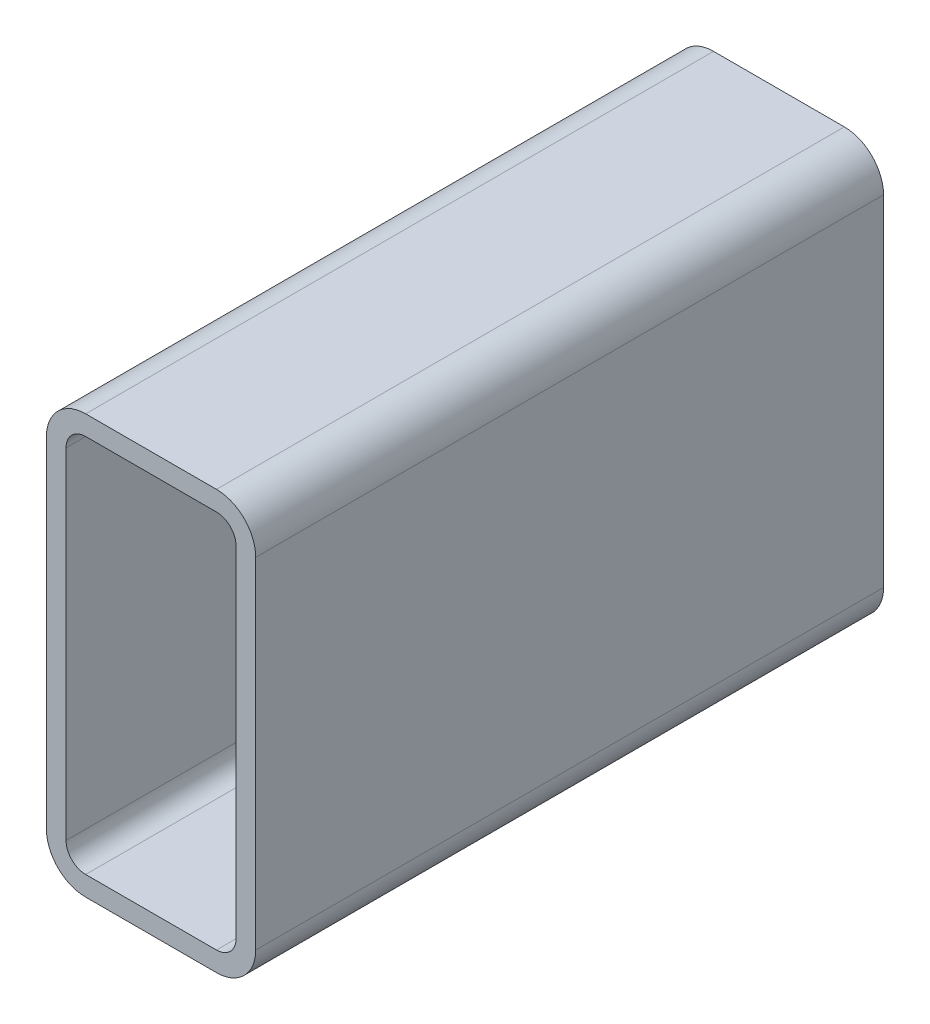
ISO-10303-21;
HEADER;
FILE_DESCRIPTION(('STEP AP214'),'2;1');
FILE_NAME('part.step','',(''),(''),'','','');
FILE_SCHEMA(('AUTOMOTIVE_DESIGN { 1 0 10303 214 1 1 1 1 }'));
ENDSEC;
DATA;
#1=APPLICATION_CONTEXT('core data for automotive mechanical design processes');
#2=APPLICATION_PROTOCOL_DEFINITION('international standard','automotive_design',2000,#1);
#3=PRODUCT_CONTEXT('',#1,'mechanical');
#4=PRODUCT('Part','Part','',(#3));
#5=PRODUCT_RELATED_PRODUCT_CATEGORY('part','',(#4));
#6=PRODUCT_DEFINITION_FORMATION('','',#4);
#7=PRODUCT_DEFINITION_CONTEXT('part definition',#1,'design');
#8=PRODUCT_DEFINITION('design','',#6,#7);
#9=PRODUCT_DEFINITION_SHAPE('','',#8);
#10=(LENGTH_UNIT() NAMED_UNIT(*) SI_UNIT(.MILLI.,.METRE.));
#11=(NAMED_UNIT(*) PLANE_ANGLE_UNIT() SI_UNIT($,.RADIAN.));
#12=(NAMED_UNIT(*) SI_UNIT($,.STERADIAN.) SOLID_ANGLE_UNIT());
#13=UNCERTAINTY_MEASURE_WITH_UNIT(LENGTH_MEASURE(1.E-05),#10,'distance_accuracy_value','');
#14=(GEOMETRIC_REPRESENTATION_CONTEXT(3) GLOBAL_UNCERTAINTY_ASSIGNED_CONTEXT((#13)) GLOBAL_UNIT_ASSIGNED_CONTEXT((#10,
#11,#12)) REPRESENTATION_CONTEXT('',''));
#15=CARTESIAN_POINT('',(0.,0.,0.));
#16=DIRECTION('',(0.,0.,1.));
#17=DIRECTION('',(1.,0.,0.));
#18=AXIS2_PLACEMENT_3D('',#15,#16,#17);
#19=CARTESIAN_POINT('',(20.7251778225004,186.116130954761,304.8));
#20=DIRECTION('',(0.,0.,1.));
#21=DIRECTION('',(1.,0.,0.));
#22=AXIS2_PLACEMENT_3D('',#19,#20,#21);
#23=PLANE('',#22);
#24=CARTESIAN_POINT('',(20.7251778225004,186.116130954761,304.8));
#25=DIRECTION('',(0.,0.,1.));
#26=DIRECTION('',(1.,0.,0.));
#27=AXIS2_PLACEMENT_3D('',#24,#25,#26);
#28=CIRCLE('',#27,19.05);
#29=CARTESIAN_POINT('',(20.7251778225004,205.166130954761,304.8));
#30=VERTEX_POINT('',#29);
#31=CARTESIAN_POINT('',(1.67517782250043,186.116130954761,304.8));
#32=VERTEX_POINT('',#31);
#33=EDGE_CURVE('E211',#30,#32,#28,.T.);
#34=ORIENTED_EDGE('',*,*,#33,.T.);
#35=DIRECTION('',(0.,-1.,0.));
#36=VECTOR('',#35,1.);
#37=CARTESIAN_POINT('',(1.67517782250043,21.0161309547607,304.8));
#38=LINE('',#37,#36);
#39=CARTESIAN_POINT('',(1.67517782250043,21.0161309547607,304.8));
#40=VERTEX_POINT('',#39);
#41=EDGE_CURVE('E214',#32,#40,#38,.T.);
#42=ORIENTED_EDGE('',*,*,#41,.T.);
#43=CARTESIAN_POINT('',(20.7251778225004,21.0161309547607,304.8));
#44=DIRECTION('',(0.,0.,1.));
#45=DIRECTION('',(1.,0.,0.));
#46=AXIS2_PLACEMENT_3D('',#43,#44,#45);
#47=CIRCLE('',#46,19.05);
#48=CARTESIAN_POINT('',(20.7251778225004,1.96613095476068,304.8));
#49=VERTEX_POINT('',#48);
#50=EDGE_CURVE('E217',#40,#49,#47,.T.);
#51=ORIENTED_EDGE('',*,*,#50,.T.);
#52=DIRECTION('',(1.,0.,0.));
#53=VECTOR('',#52,1.);
#54=CARTESIAN_POINT('',(84.2251778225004,1.96613095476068,304.8));
#55=LINE('',#54,#53);
#56=CARTESIAN_POINT('',(84.2251778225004,1.96613095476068,304.8));
#57=VERTEX_POINT('',#56);
#58=EDGE_CURVE('E219',#49,#57,#55,.T.);
#59=ORIENTED_EDGE('',*,*,#58,.T.);
#60=CARTESIAN_POINT('',(84.2251778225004,21.0161309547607,304.8));
#61=DIRECTION('',(0.,0.,1.));
#62=DIRECTION('',(1.,0.,0.));
#63=AXIS2_PLACEMENT_3D('',#60,#61,#62);
#64=CIRCLE('',#63,19.05);
#65=CARTESIAN_POINT('',(103.2751778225,21.0161309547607,304.8));
#66=VERTEX_POINT('',#65);
#67=EDGE_CURVE('E221',#57,#66,#64,.T.);
#68=ORIENTED_EDGE('',*,*,#67,.T.);
#69=DIRECTION('',(0.,1.,0.));
#70=VECTOR('',#69,1.);
#71=CARTESIAN_POINT('',(103.2751778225,186.116130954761,304.8));
#72=LINE('',#71,#70);
#73=CARTESIAN_POINT('',(103.2751778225,186.116130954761,304.8));
#74=VERTEX_POINT('',#73);
#75=EDGE_CURVE('E223',#66,#74,#72,.T.);
#76=ORIENTED_EDGE('',*,*,#75,.T.);
#77=CARTESIAN_POINT('',(84.2251778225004,186.116130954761,304.8));
#78=DIRECTION('',(0.,0.,1.));
#79=DIRECTION('',(1.,0.,0.));
#80=AXIS2_PLACEMENT_3D('',#77,#78,#79);
#81=CIRCLE('',#80,19.05);
#82=CARTESIAN_POINT('',(84.2251778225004,205.166130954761,304.8));
#83=VERTEX_POINT('',#82);
#84=EDGE_CURVE('E225',#74,#83,#81,.T.);
#85=ORIENTED_EDGE('',*,*,#84,.T.);
#86=DIRECTION('',(-1.,0.,0.));
#87=VECTOR('',#86,1.);
#88=CARTESIAN_POINT('',(20.7251778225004,205.166130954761,304.8));
#89=LINE('',#88,#87);
#90=EDGE_CURVE('E227',#83,#30,#89,.T.);
#91=ORIENTED_EDGE('',*,*,#90,.T.);
#92=EDGE_LOOP('',(#34,#42,#51,#59,#68,#76,#85,#91));
#93=FACE_BOUND('',#92,.T.);
#94=DIRECTION('',(0.,-1.,0.));
#95=VECTOR('',#94,1.);
#96=CARTESIAN_POINT('',(11.2001778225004,21.0161309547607,304.8));
#97=LINE('',#96,#95);
#98=CARTESIAN_POINT('',(11.2001778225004,186.116130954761,304.8));
#99=VERTEX_POINT('',#98);
#100=CARTESIAN_POINT('',(11.2001778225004,21.0161309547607,304.8));
#101=VERTEX_POINT('',#100);
#102=EDGE_CURVE('E154',#99,#101,#97,.T.);
#103=ORIENTED_EDGE('',*,*,#102,.F.);
#104=CARTESIAN_POINT('',(20.7251778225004,186.116130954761,304.8));
#105=DIRECTION('',(0.,0.,1.));
#106=DIRECTION('',(1.,0.,0.));
#107=AXIS2_PLACEMENT_3D('',#104,#105,#106);
#108=CIRCLE('',#107,9.52500000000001);
#109=CARTESIAN_POINT('',(20.7251778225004,195.641130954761,304.8));
#110=VERTEX_POINT('',#109);
#111=EDGE_CURVE('E146',#110,#99,#108,.T.);
#112=ORIENTED_EDGE('',*,*,#111,.F.);
#113=DIRECTION('',(-1.,0.,0.));
#114=VECTOR('',#113,1.);
#115=CARTESIAN_POINT('',(20.7251778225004,195.641130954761,304.8));
#116=LINE('',#115,#114);
#117=CARTESIAN_POINT('',(84.2251778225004,195.641130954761,304.8));
#118=VERTEX_POINT('',#117);
#119=EDGE_CURVE('E179',#118,#110,#116,.T.);
#120=ORIENTED_EDGE('',*,*,#119,.F.);
#121=CARTESIAN_POINT('',(84.2251778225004,186.116130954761,304.8));
#122=DIRECTION('',(0.,0.,1.));
#123=DIRECTION('',(1.,0.,0.));
#124=AXIS2_PLACEMENT_3D('',#121,#122,#123);
#125=CIRCLE('',#124,9.52500000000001);
#126=CARTESIAN_POINT('',(93.7501778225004,186.116130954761,304.8));
#127=VERTEX_POINT('',#126);
#128=EDGE_CURVE('E177',#127,#118,#125,.T.);
#129=ORIENTED_EDGE('',*,*,#128,.F.);
#130=DIRECTION('',(0.,1.,0.));
#131=VECTOR('',#130,1.);
#132=CARTESIAN_POINT('',(93.7501778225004,186.116130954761,304.8));
#133=LINE('',#132,#131);
#134=CARTESIAN_POINT('',(93.7501778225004,21.0161309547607,304.8));
#135=VERTEX_POINT('',#134);
#136=EDGE_CURVE('E175',#135,#127,#133,.T.);
#137=ORIENTED_EDGE('',*,*,#136,.F.);
#138=CARTESIAN_POINT('',(84.2251778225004,21.0161309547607,304.8));
#139=DIRECTION('',(0.,0.,1.));
#140=DIRECTION('',(1.,0.,0.));
#141=AXIS2_PLACEMENT_3D('',#138,#139,#140);
#142=CIRCLE('',#141,9.52500000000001);
#143=CARTESIAN_POINT('',(84.2251778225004,11.4911309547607,304.8));
#144=VERTEX_POINT('',#143);
#145=EDGE_CURVE('E173',#144,#135,#142,.T.);
#146=ORIENTED_EDGE('',*,*,#145,.F.);
#147=DIRECTION('',(1.,0.,0.));
#148=VECTOR('',#147,1.);
#149=CARTESIAN_POINT('',(84.2251778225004,11.4911309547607,304.8));
#150=LINE('',#149,#148);
#151=CARTESIAN_POINT('',(20.7251778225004,11.4911309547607,304.8));
#152=VERTEX_POINT('',#151);
#153=EDGE_CURVE('E169',#152,#144,#150,.T.);
#154=ORIENTED_EDGE('',*,*,#153,.F.);
#155=CARTESIAN_POINT('',(20.7251778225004,21.0161309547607,304.8));
#156=DIRECTION('',(0.,0.,1.));
#157=DIRECTION('',(1.,0.,0.));
#158=AXIS2_PLACEMENT_3D('',#155,#156,#157);
#159=CIRCLE('',#158,9.525);
#160=EDGE_CURVE('E167',#101,#152,#159,.T.);
#161=ORIENTED_EDGE('',*,*,#160,.F.);
#162=EDGE_LOOP('',(#103,#112,#120,#129,#137,#146,#154,#161));
#163=FACE_BOUND('',#162,.T.);
#164=ADVANCED_FACE('F33',(#93,#163),#23,.T.);
#165=CARTESIAN_POINT('',(20.7251778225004,186.116130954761,0.));
#166=DIRECTION('',(0.,0.,1.));
#167=DIRECTION('',(1.,0.,0.));
#168=AXIS2_PLACEMENT_3D('',#165,#166,#167);
#169=PLANE('',#168);
#170=CARTESIAN_POINT('',(20.7251778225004,186.116130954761,0.));
#171=DIRECTION('',(0.,0.,1.));
#172=DIRECTION('',(1.,0.,0.));
#173=AXIS2_PLACEMENT_3D('',#170,#171,#172);
#174=CIRCLE('',#173,19.05);
#175=CARTESIAN_POINT('',(20.7251778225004,205.166130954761,0.));
#176=VERTEX_POINT('',#175);
#177=CARTESIAN_POINT('',(1.67517782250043,186.116130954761,0.));
#178=VERTEX_POINT('',#177);
#179=EDGE_CURVE('E162',#176,#178,#174,.T.);
#180=ORIENTED_EDGE('',*,*,#179,.F.);
#181=DIRECTION('',(-1.,0.,0.));
#182=VECTOR('',#181,1.);
#183=CARTESIAN_POINT('',(20.7251778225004,205.166130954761,0.));
#184=LINE('',#183,#182);
#185=CARTESIAN_POINT('',(84.2251778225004,205.166130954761,0.));
#186=VERTEX_POINT('',#185);
#187=EDGE_CURVE('E215',#186,#176,#184,.T.);
#188=ORIENTED_EDGE('',*,*,#187,.F.);
#189=CARTESIAN_POINT('',(84.2251778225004,186.116130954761,0.));
#190=DIRECTION('',(0.,0.,1.));
#191=DIRECTION('',(1.,0.,0.));
#192=AXIS2_PLACEMENT_3D('',#189,#190,#191);
#193=CIRCLE('',#192,19.05);
#194=CARTESIAN_POINT('',(103.2751778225,186.116130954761,0.));
#195=VERTEX_POINT('',#194);
#196=EDGE_CURVE('E242',#195,#186,#193,.T.);
#197=ORIENTED_EDGE('',*,*,#196,.F.);
#198=DIRECTION('',(0.,1.,0.));
#199=VECTOR('',#198,1.);
#200=CARTESIAN_POINT('',(103.2751778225,186.116130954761,0.));
#201=LINE('',#200,#199);
#202=CARTESIAN_POINT('',(103.2751778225,21.0161309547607,0.));
#203=VERTEX_POINT('',#202);
#204=EDGE_CURVE('E240',#203,#195,#201,.T.);
#205=ORIENTED_EDGE('',*,*,#204,.F.);
#206=CARTESIAN_POINT('',(84.2251778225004,21.0161309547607,0.));
#207=DIRECTION('',(0.,0.,1.));
#208=DIRECTION('',(1.,0.,0.));
#209=AXIS2_PLACEMENT_3D('',#206,#207,#208);
#210=CIRCLE('',#209,19.05);
#211=CARTESIAN_POINT('',(84.2251778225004,1.96613095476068,0.));
#212=VERTEX_POINT('',#211);
#213=EDGE_CURVE('E238',#212,#203,#210,.T.);
#214=ORIENTED_EDGE('',*,*,#213,.F.);
#215=DIRECTION('',(1.,0.,0.));
#216=VECTOR('',#215,1.);
#217=CARTESIAN_POINT('',(84.2251778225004,1.96613095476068,0.));
#218=LINE('',#217,#216);
#219=CARTESIAN_POINT('',(20.7251778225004,1.96613095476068,0.));
#220=VERTEX_POINT('',#219);
#221=EDGE_CURVE('E236',#220,#212,#218,.T.);
#222=ORIENTED_EDGE('',*,*,#221,.F.);
#223=CARTESIAN_POINT('',(20.7251778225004,21.0161309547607,0.));
#224=DIRECTION('',(0.,0.,1.));
#225=DIRECTION('',(1.,0.,0.));
#226=AXIS2_PLACEMENT_3D('',#223,#224,#225);
#227=CIRCLE('',#226,19.05);
#228=CARTESIAN_POINT('',(1.67517782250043,21.0161309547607,0.));
#229=VERTEX_POINT('',#228);
#230=EDGE_CURVE('E234',#229,#220,#227,.T.);
#231=ORIENTED_EDGE('',*,*,#230,.F.);
#232=DIRECTION('',(0.,-1.,0.));
#233=VECTOR('',#232,1.);
#234=CARTESIAN_POINT('',(1.67517782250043,21.0161309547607,0.));
#235=LINE('',#234,#233);
#236=EDGE_CURVE('E232',#178,#229,#235,.T.);
#237=ORIENTED_EDGE('',*,*,#236,.F.);
#238=EDGE_LOOP('',(#180,#188,#197,#205,#214,#222,#231,#237));
#239=FACE_BOUND('',#238,.T.);
#240=CARTESIAN_POINT('',(20.7251778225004,186.116130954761,0.));
#241=DIRECTION('',(0.,0.,1.));
#242=DIRECTION('',(1.,0.,0.));
#243=AXIS2_PLACEMENT_3D('',#240,#241,#242);
#244=CIRCLE('',#243,9.52500000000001);
#245=CARTESIAN_POINT('',(20.7251778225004,195.641130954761,0.));
#246=VERTEX_POINT('',#245);
#247=CARTESIAN_POINT('',(11.2001778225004,186.116130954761,0.));
#248=VERTEX_POINT('',#247);
#249=EDGE_CURVE('E56',#246,#248,#244,.T.);
#250=ORIENTED_EDGE('',*,*,#249,.T.);
#251=DIRECTION('',(0.,-1.,0.));
#252=VECTOR('',#251,1.);
#253=CARTESIAN_POINT('',(11.2001778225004,21.0161309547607,0.));
#254=LINE('',#253,#252);
#255=CARTESIAN_POINT('',(11.2001778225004,21.0161309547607,0.));
#256=VERTEX_POINT('',#255);
#257=EDGE_CURVE('E161',#248,#256,#254,.T.);
#258=ORIENTED_EDGE('',*,*,#257,.T.);
#259=CARTESIAN_POINT('',(20.7251778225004,21.0161309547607,0.));
#260=DIRECTION('',(0.,0.,1.));
#261=DIRECTION('',(1.,0.,0.));
#262=AXIS2_PLACEMENT_3D('',#259,#260,#261);
#263=CIRCLE('',#262,9.525);
#264=CARTESIAN_POINT('',(20.7251778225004,11.4911309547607,0.));
#265=VERTEX_POINT('',#264);
#266=EDGE_CURVE('E183',#256,#265,#263,.T.);
#267=ORIENTED_EDGE('',*,*,#266,.T.);
#268=DIRECTION('',(1.,0.,0.));
#269=VECTOR('',#268,1.);
#270=CARTESIAN_POINT('',(84.2251778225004,11.4911309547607,0.));
#271=LINE('',#270,#269);
#272=CARTESIAN_POINT('',(84.2251778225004,11.4911309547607,0.));
#273=VERTEX_POINT('',#272);
#274=EDGE_CURVE('E186',#265,#273,#271,.T.);
#275=ORIENTED_EDGE('',*,*,#274,.T.);
#276=CARTESIAN_POINT('',(84.2251778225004,21.0161309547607,0.));
#277=DIRECTION('',(0.,0.,1.));
#278=DIRECTION('',(1.,0.,0.));
#279=AXIS2_PLACEMENT_3D('',#276,#277,#278);
#280=CIRCLE('',#279,9.52500000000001);
#281=CARTESIAN_POINT('',(93.7501778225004,21.0161309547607,0.));
#282=VERTEX_POINT('',#281);
#283=EDGE_CURVE('E189',#273,#282,#280,.T.);
#284=ORIENTED_EDGE('',*,*,#283,.T.);
#285=DIRECTION('',(0.,1.,0.));
#286=VECTOR('',#285,1.);
#287=CARTESIAN_POINT('',(93.7501778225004,186.116130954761,0.));
#288=LINE('',#287,#286);
#289=CARTESIAN_POINT('',(93.7501778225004,186.116130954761,0.));
#290=VERTEX_POINT('',#289);
#291=EDGE_CURVE('E192',#282,#290,#288,.T.);
#292=ORIENTED_EDGE('',*,*,#291,.T.);
#293=CARTESIAN_POINT('',(84.2251778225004,186.116130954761,0.));
#294=DIRECTION('',(0.,0.,1.));
#295=DIRECTION('',(1.,0.,0.));
#296=AXIS2_PLACEMENT_3D('',#293,#294,#295);
#297=CIRCLE('',#296,9.52500000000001);
#298=CARTESIAN_POINT('',(84.2251778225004,195.641130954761,0.));
#299=VERTEX_POINT('',#298);
#300=EDGE_CURVE('E195',#290,#299,#297,.T.);
#301=ORIENTED_EDGE('',*,*,#300,.T.);
#302=DIRECTION('',(-1.,0.,0.));
#303=VECTOR('',#302,1.);
#304=CARTESIAN_POINT('',(20.7251778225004,195.641130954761,0.));
#305=LINE('',#304,#303);
#306=EDGE_CURVE('E155',#299,#246,#305,.T.);
#307=ORIENTED_EDGE('',*,*,#306,.T.);
#308=EDGE_LOOP('',(#250,#258,#267,#275,#284,#292,#301,#307));
#309=FACE_BOUND('',#308,.T.);
#310=ADVANCED_FACE('F272',(#239,#309),#169,.F.);
#311=CARTESIAN_POINT('',(20.7251778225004,186.116130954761,304.8));
#312=DIRECTION('',(0.,0.,-1.));
#313=DIRECTION('',(-1.,0.,0.));
#314=AXIS2_PLACEMENT_3D('',#311,#312,#313);
#315=CYLINDRICAL_SURFACE('',#314,19.05);
#316=ORIENTED_EDGE('',*,*,#179,.T.);
#317=DIRECTION('',(0.,0.,-1.));
#318=VECTOR('',#317,1.);
#319=CARTESIAN_POINT('',(1.67517782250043,186.116130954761,304.8));
#320=LINE('',#319,#318);
#321=EDGE_CURVE('E11',#32,#178,#320,.T.);
#322=ORIENTED_EDGE('',*,*,#321,.F.);
#323=ORIENTED_EDGE('',*,*,#33,.F.);
#324=DIRECTION('',(0.,0.,-1.));
#325=VECTOR('',#324,1.);
#326=CARTESIAN_POINT('',(20.7251778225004,205.166130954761,304.8));
#327=LINE('',#326,#325);
#328=EDGE_CURVE('E229',#30,#176,#327,.T.);
#329=ORIENTED_EDGE('',*,*,#328,.T.);
#330=EDGE_LOOP('',(#316,#322,#323,#329));
#331=FACE_BOUND('',#330,.T.);
#332=ADVANCED_FACE('F35',(#331),#315,.T.);
#333=CARTESIAN_POINT('',(1.67517782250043,21.0161309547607,304.8));
#334=DIRECTION('',(1.,0.,0.));
#335=DIRECTION('',(0.,0.,-1.));
#336=AXIS2_PLACEMENT_3D('',#333,#334,#335);
#337=PLANE('',#336);
#338=ORIENTED_EDGE('',*,*,#236,.T.);
#339=DIRECTION('',(0.,0.,-1.));
#340=VECTOR('',#339,1.);
#341=CARTESIAN_POINT('',(1.67517782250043,21.0161309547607,304.8));
#342=LINE('',#341,#340);
#343=EDGE_CURVE('E41',#40,#229,#342,.T.);
#344=ORIENTED_EDGE('',*,*,#343,.F.);
#345=ORIENTED_EDGE('',*,*,#41,.F.);
#346=ORIENTED_EDGE('',*,*,#321,.T.);
#347=EDGE_LOOP('',(#338,#344,#345,#346));
#348=FACE_BOUND('',#347,.T.);
#349=ADVANCED_FACE('F289',(#348),#337,.F.);
#350=CARTESIAN_POINT('',(20.7251778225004,21.0161309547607,304.8));
#351=DIRECTION('',(0.,0.,-1.));
#352=DIRECTION('',(-1.,0.,0.));
#353=AXIS2_PLACEMENT_3D('',#350,#351,#352);
#354=CYLINDRICAL_SURFACE('',#353,19.05);
#355=ORIENTED_EDGE('',*,*,#230,.T.);
#356=DIRECTION('',(0.,0.,-1.));
#357=VECTOR('',#356,1.);
#358=CARTESIAN_POINT('',(20.7251778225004,1.96613095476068,304.8));
#359=LINE('',#358,#357);
#360=EDGE_CURVE('E259',#49,#220,#359,.T.);
#361=ORIENTED_EDGE('',*,*,#360,.F.);
#362=ORIENTED_EDGE('',*,*,#50,.F.);
#363=ORIENTED_EDGE('',*,*,#343,.T.);
#364=EDGE_LOOP('',(#355,#361,#362,#363));
#365=FACE_BOUND('',#364,.T.);
#366=ADVANCED_FACE('F266',(#365),#354,.T.);
#367=CARTESIAN_POINT('',(84.2251778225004,1.96613095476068,304.8));
#368=DIRECTION('',(0.,1.,0.));
#369=DIRECTION('',(0.,0.,1.));
#370=AXIS2_PLACEMENT_3D('',#367,#368,#369);
#371=PLANE('',#370);
#372=ORIENTED_EDGE('',*,*,#221,.T.);
#373=DIRECTION('',(0.,0.,-1.));
#374=VECTOR('',#373,1.);
#375=CARTESIAN_POINT('',(84.2251778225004,1.96613095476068,304.8));
#376=LINE('',#375,#374);
#377=EDGE_CURVE('E256',#57,#212,#376,.T.);
#378=ORIENTED_EDGE('',*,*,#377,.F.);
#379=ORIENTED_EDGE('',*,*,#58,.F.);
#380=ORIENTED_EDGE('',*,*,#360,.T.);
#381=EDGE_LOOP('',(#372,#378,#379,#380));
#382=FACE_BOUND('',#381,.T.);
#383=ADVANCED_FACE('F278',(#382),#371,.F.);
#384=CARTESIAN_POINT('',(84.2251778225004,21.0161309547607,304.8));
#385=DIRECTION('',(0.,0.,-1.));
#386=DIRECTION('',(-1.,0.,0.));
#387=AXIS2_PLACEMENT_3D('',#384,#385,#386);
#388=CYLINDRICAL_SURFACE('',#387,19.05);
#389=ORIENTED_EDGE('',*,*,#213,.T.);
#390=DIRECTION('',(0.,0.,-1.));
#391=VECTOR('',#390,1.);
#392=CARTESIAN_POINT('',(103.2751778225,21.0161309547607,304.8));
#393=LINE('',#392,#391);
#394=EDGE_CURVE('E253',#66,#203,#393,.T.);
#395=ORIENTED_EDGE('',*,*,#394,.F.);
#396=ORIENTED_EDGE('',*,*,#67,.F.);
#397=ORIENTED_EDGE('',*,*,#377,.T.);
#398=EDGE_LOOP('',(#389,#395,#396,#397));
#399=FACE_BOUND('',#398,.T.);
#400=ADVANCED_FACE('F282',(#399),#388,.T.);
#401=CARTESIAN_POINT('',(103.2751778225,186.116130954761,304.8));
#402=DIRECTION('',(-1.,0.,0.));
#403=DIRECTION('',(0.,0.,1.));
#404=AXIS2_PLACEMENT_3D('',#401,#402,#403);
#405=PLANE('',#404);
#406=ORIENTED_EDGE('',*,*,#204,.T.);
#407=DIRECTION('',(0.,0.,-1.));
#408=VECTOR('',#407,1.);
#409=CARTESIAN_POINT('',(103.2751778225,186.116130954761,304.8));
#410=LINE('',#409,#408);
#411=EDGE_CURVE('E250',#74,#195,#410,.T.);
#412=ORIENTED_EDGE('',*,*,#411,.F.);
#413=ORIENTED_EDGE('',*,*,#75,.F.);
#414=ORIENTED_EDGE('',*,*,#394,.T.);
#415=EDGE_LOOP('',(#406,#412,#413,#414));
#416=FACE_BOUND('',#415,.T.);
#417=ADVANCED_FACE('F302',(#416),#405,.F.);
#418=CARTESIAN_POINT('',(84.2251778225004,186.116130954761,304.8));
#419=DIRECTION('',(0.,0.,-1.));
#420=DIRECTION('',(-1.,0.,0.));
#421=AXIS2_PLACEMENT_3D('',#418,#419,#420);
#422=CYLINDRICAL_SURFACE('',#421,19.05);
#423=ORIENTED_EDGE('',*,*,#196,.T.);
#424=DIRECTION('',(0.,0.,-1.));
#425=VECTOR('',#424,1.);
#426=CARTESIAN_POINT('',(84.2251778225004,205.166130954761,304.8));
#427=LINE('',#426,#425);
#428=EDGE_CURVE('E247',#83,#186,#427,.T.);
#429=ORIENTED_EDGE('',*,*,#428,.F.);
#430=ORIENTED_EDGE('',*,*,#84,.F.);
#431=ORIENTED_EDGE('',*,*,#411,.T.);
#432=EDGE_LOOP('',(#423,#429,#430,#431));
#433=FACE_BOUND('',#432,.T.);
#434=ADVANCED_FACE('F300',(#433),#422,.T.);
#435=CARTESIAN_POINT('',(20.7251778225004,205.166130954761,304.8));
#436=DIRECTION('',(0.,-1.,0.));
#437=DIRECTION('',(0.,0.,-1.));
#438=AXIS2_PLACEMENT_3D('',#435,#436,#437);
#439=PLANE('',#438);
#440=ORIENTED_EDGE('',*,*,#187,.T.);
#441=ORIENTED_EDGE('',*,*,#328,.F.);
#442=ORIENTED_EDGE('',*,*,#90,.F.);
#443=ORIENTED_EDGE('',*,*,#428,.T.);
#444=EDGE_LOOP('',(#440,#441,#442,#443));
#445=FACE_BOUND('',#444,.T.);
#446=ADVANCED_FACE('F295',(#445),#439,.F.);
#447=CARTESIAN_POINT('',(20.7251778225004,186.116130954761,304.8));
#448=DIRECTION('',(0.,0.,-1.));
#449=DIRECTION('',(-1.,0.,0.));
#450=AXIS2_PLACEMENT_3D('',#447,#448,#449);
#451=CYLINDRICAL_SURFACE('',#450,9.52500000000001);
#452=ORIENTED_EDGE('',*,*,#249,.F.);
#453=DIRECTION('',(0.,0.,-1.));
#454=VECTOR('',#453,1.);
#455=CARTESIAN_POINT('',(20.7251778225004,195.641130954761,304.8));
#456=LINE('',#455,#454);
#457=EDGE_CURVE('E150',#110,#246,#456,.T.);
#458=ORIENTED_EDGE('',*,*,#457,.F.);
#459=ORIENTED_EDGE('',*,*,#111,.T.);
#460=DIRECTION('',(0.,0.,-1.));
#461=VECTOR('',#460,1.);
#462=CARTESIAN_POINT('',(11.2001778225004,186.116130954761,304.8));
#463=LINE('',#462,#461);
#464=EDGE_CURVE('E149',#99,#248,#463,.T.);
#465=ORIENTED_EDGE('',*,*,#464,.T.);
#466=EDGE_LOOP('',(#452,#458,#459,#465));
#467=FACE_BOUND('',#466,.T.);
#468=ADVANCED_FACE('F148',(#467),#451,.F.);
#469=CARTESIAN_POINT('',(11.2001778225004,21.0161309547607,304.8));
#470=DIRECTION('',(1.,0.,0.));
#471=DIRECTION('',(0.,0.,-1.));
#472=AXIS2_PLACEMENT_3D('',#469,#470,#471);
#473=PLANE('',#472);
#474=ORIENTED_EDGE('',*,*,#257,.F.);
#475=ORIENTED_EDGE('',*,*,#464,.F.);
#476=ORIENTED_EDGE('',*,*,#102,.T.);
#477=DIRECTION('',(0.,0.,-1.));
#478=VECTOR('',#477,1.);
#479=CARTESIAN_POINT('',(11.2001778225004,21.0161309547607,304.8));
#480=LINE('',#479,#478);
#481=EDGE_CURVE('E163',#101,#256,#480,.T.);
#482=ORIENTED_EDGE('',*,*,#481,.T.);
#483=EDGE_LOOP('',(#474,#475,#476,#482));
#484=FACE_BOUND('',#483,.T.);
#485=ADVANCED_FACE('F158',(#484),#473,.T.);
#486=CARTESIAN_POINT('',(20.7251778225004,21.0161309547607,304.8));
#487=DIRECTION('',(0.,0.,-1.));
#488=DIRECTION('',(-1.,0.,0.));
#489=AXIS2_PLACEMENT_3D('',#486,#487,#488);
#490=CYLINDRICAL_SURFACE('',#489,9.525);
#491=ORIENTED_EDGE('',*,*,#266,.F.);
#492=ORIENTED_EDGE('',*,*,#481,.F.);
#493=ORIENTED_EDGE('',*,*,#160,.T.);
#494=DIRECTION('',(0.,0.,-1.));
#495=VECTOR('',#494,1.);
#496=CARTESIAN_POINT('',(20.7251778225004,11.4911309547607,304.8));
#497=LINE('',#496,#495);
#498=EDGE_CURVE('E208',#152,#265,#497,.T.);
#499=ORIENTED_EDGE('',*,*,#498,.T.);
#500=EDGE_LOOP('',(#491,#492,#493,#499));
#501=FACE_BOUND('',#500,.T.);
#502=ADVANCED_FACE('F327',(#501),#490,.F.);
#503=CARTESIAN_POINT('',(84.2251778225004,11.4911309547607,304.8));
#504=DIRECTION('',(0.,1.,0.));
#505=DIRECTION('',(0.,0.,1.));
#506=AXIS2_PLACEMENT_3D('',#503,#504,#505);
#507=PLANE('',#506);
#508=ORIENTED_EDGE('',*,*,#274,.F.);
#509=ORIENTED_EDGE('',*,*,#498,.F.);
#510=ORIENTED_EDGE('',*,*,#153,.T.);
#511=DIRECTION('',(0.,0.,-1.));
#512=VECTOR('',#511,1.);
#513=CARTESIAN_POINT('',(84.2251778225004,11.4911309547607,304.8));
#514=LINE('',#513,#512);
#515=EDGE_CURVE('E206',#144,#273,#514,.T.);
#516=ORIENTED_EDGE('',*,*,#515,.T.);
#517=EDGE_LOOP('',(#508,#509,#510,#516));
#518=FACE_BOUND('',#517,.T.);
#519=ADVANCED_FACE('F331',(#518),#507,.T.);
#520=CARTESIAN_POINT('',(84.2251778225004,21.0161309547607,304.8));
#521=DIRECTION('',(0.,0.,-1.));
#522=DIRECTION('',(-1.,0.,0.));
#523=AXIS2_PLACEMENT_3D('',#520,#521,#522);
#524=CYLINDRICAL_SURFACE('',#523,9.52500000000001);
#525=ORIENTED_EDGE('',*,*,#283,.F.);
#526=ORIENTED_EDGE('',*,*,#515,.F.);
#527=ORIENTED_EDGE('',*,*,#145,.T.);
#528=DIRECTION('',(0.,0.,-1.));
#529=VECTOR('',#528,1.);
#530=CARTESIAN_POINT('',(93.7501778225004,21.0161309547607,304.8));
#531=LINE('',#530,#529);
#532=EDGE_CURVE('E204',#135,#282,#531,.T.);
#533=ORIENTED_EDGE('',*,*,#532,.T.);
#534=EDGE_LOOP('',(#525,#526,#527,#533));
#535=FACE_BOUND('',#534,.T.);
#536=ADVANCED_FACE('F337',(#535),#524,.F.);
#537=CARTESIAN_POINT('',(93.7501778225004,186.116130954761,304.8));
#538=DIRECTION('',(-1.,0.,0.));
#539=DIRECTION('',(0.,0.,1.));
#540=AXIS2_PLACEMENT_3D('',#537,#538,#539);
#541=PLANE('',#540);
#542=ORIENTED_EDGE('',*,*,#291,.F.);
#543=ORIENTED_EDGE('',*,*,#532,.F.);
#544=ORIENTED_EDGE('',*,*,#136,.T.);
#545=DIRECTION('',(0.,0.,-1.));
#546=VECTOR('',#545,1.);
#547=CARTESIAN_POINT('',(93.7501778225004,186.116130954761,304.8));
#548=LINE('',#547,#546);
#549=EDGE_CURVE('E202',#127,#290,#548,.T.);
#550=ORIENTED_EDGE('',*,*,#549,.T.);
#551=EDGE_LOOP('',(#542,#543,#544,#550));
#552=FACE_BOUND('',#551,.T.);
#553=ADVANCED_FACE('F341',(#552),#541,.T.);
#554=CARTESIAN_POINT('',(84.2251778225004,186.116130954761,304.8));
#555=DIRECTION('',(0.,0.,-1.));
#556=DIRECTION('',(-1.,0.,0.));
#557=AXIS2_PLACEMENT_3D('',#554,#555,#556);
#558=CYLINDRICAL_SURFACE('',#557,9.52500000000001);
#559=ORIENTED_EDGE('',*,*,#300,.F.);
#560=ORIENTED_EDGE('',*,*,#549,.F.);
#561=ORIENTED_EDGE('',*,*,#128,.T.);
#562=DIRECTION('',(0.,0.,-1.));
#563=VECTOR('',#562,1.);
#564=CARTESIAN_POINT('',(84.2251778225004,195.641130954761,304.8));
#565=LINE('',#564,#563);
#566=EDGE_CURVE('E48',#118,#299,#565,.T.);
#567=ORIENTED_EDGE('',*,*,#566,.T.);
#568=EDGE_LOOP('',(#559,#560,#561,#567));
#569=FACE_BOUND('',#568,.T.);
#570=ADVANCED_FACE('F345',(#569),#558,.F.);
#571=CARTESIAN_POINT('',(20.7251778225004,195.641130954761,304.8));
#572=DIRECTION('',(0.,-1.,0.));
#573=DIRECTION('',(0.,0.,-1.));
#574=AXIS2_PLACEMENT_3D('',#571,#572,#573);
#575=PLANE('',#574);
#576=ORIENTED_EDGE('',*,*,#306,.F.);
#577=ORIENTED_EDGE('',*,*,#566,.F.);
#578=ORIENTED_EDGE('',*,*,#119,.T.);
#579=ORIENTED_EDGE('',*,*,#457,.T.);
#580=EDGE_LOOP('',(#576,#577,#578,#579));
#581=FACE_BOUND('',#580,.T.);
#582=ADVANCED_FACE('F349',(#581),#575,.T.);
#583=CLOSED_SHELL('',(#164,#310,#332,#349,#366,#383,#400,#417,#434,#446,#468,#485,#502,#519,
#536,#553,#570,#582));
#584=MANIFOLD_SOLID_BREP('B2',#583);
#585=ADVANCED_BREP_SHAPE_REPRESENTATION('',(#18,#584),#14);
#586=SHAPE_DEFINITION_REPRESENTATION(#9,#585);
ENDSEC;
END-ISO-10303-21;
